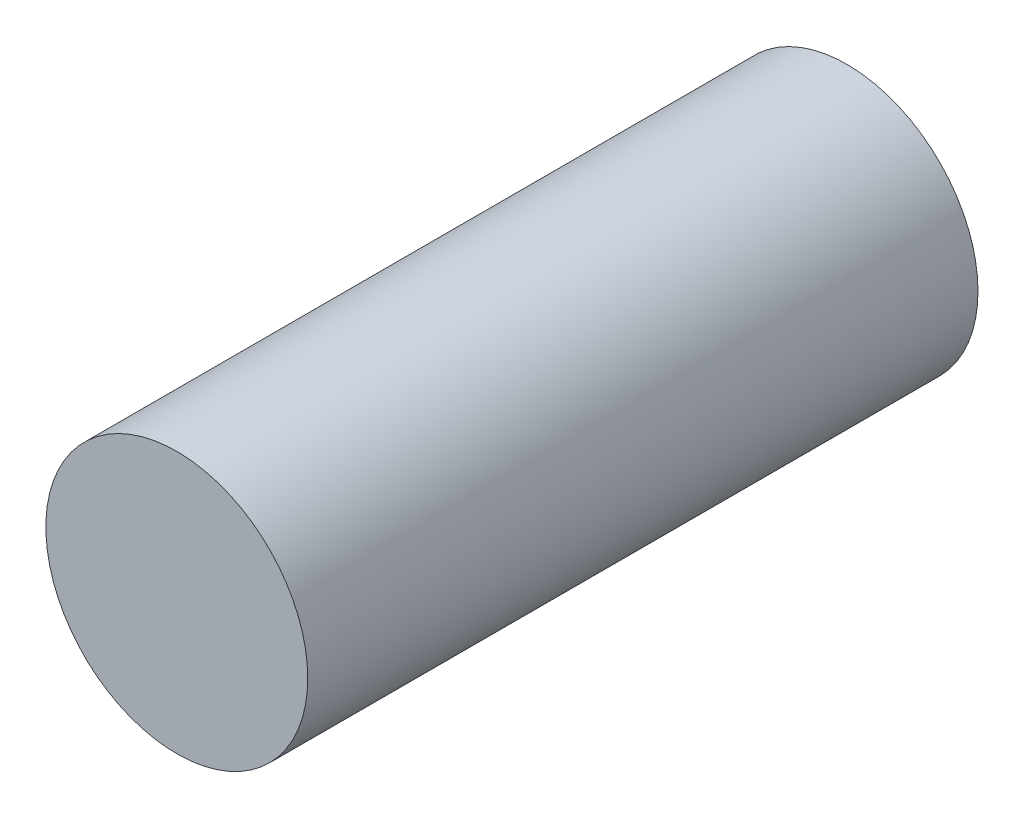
from build123d import *

# Parameters (mm, degrees)
ESBO_O1_R                = 12.7
RESSALTO_EXTRUS_O1_DEPTH = 65


with BuildPart() as part:
    # Esbo_o1 → Ressalto-extrus_o1 (new body)
    with BuildSketch(Plane.XY):
        Circle(ESBO_O1_R)
    extrude(amount=RESSALTO_EXTRUS_O1_DEPTH)


solid = part.part
